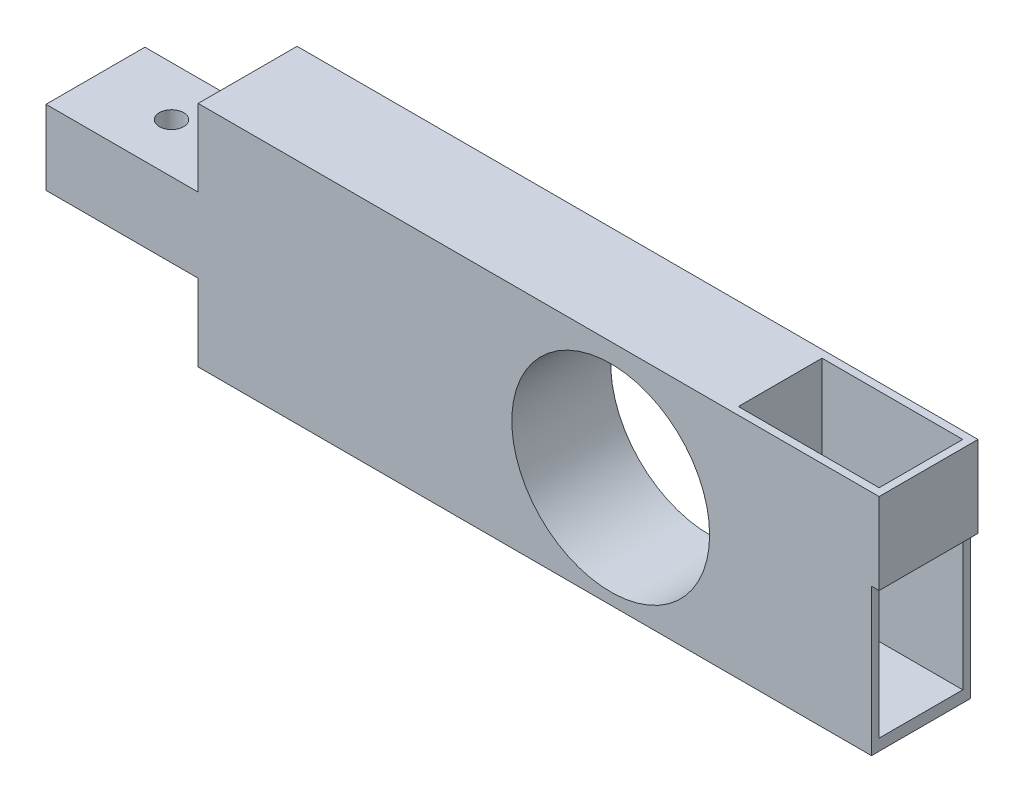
from build123d import *

# Parameters (mm, degrees)
SKETCH1_W               = 355.325
SKETCH1_H               = 30
SKETCH1_R               = 12.5
SKETCH1_R_2             = 1
SKETCH1_W_2             = 50
SKETCH1_H_2             = 5
BOSS_EXTRUDE3_DEPTH     = 13
FILLET3_R               = 5
SKETCH3_R               = 12.5
BOSS_EXTRUDE4_DEPTH     = 13
CUT_EXTRUDE1_REACH      = 359.536
SKETCH4_R               = 1.425
SKETCH5_W               = 63.83
SKETCH5_H               = 18
CUT_EXTRUDE3_DEPTH      = 358.535810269
FILLET4_R               = 5
SKETCH6_W               = 63.8325
SKETCH6_H               = 17
CUT_EXTRUDE4_DEPTH      = 5
SKETCH7_R               = 2.159563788
SKETCH7_R_2             = 1
SKETCH7_R_3             = 2.117135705
SKETCH7_R_4             = 1.916104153
SKETCH7_R_5             = 2.415941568
BOSS_EXTRUDE5_DEPTH     = 8
SKETCH8_R               = 12.5
BOSS_EXTRUDE6_DEPTH     = 13
CUT_EXTRUDE5_DEPTH      = 358.535810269
CUT_EXTRUDE5_DEPTH_BACK = 358.535810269
SKETCH10_R              = 12.5
SKETCH10_R_2            = 13
SKETCH13_W              = 13
SKETCH13_H              = 30
BOSS_EXTRUDE7_DEPTH     = 5
SKETCH14_W              = 13
SKETCH14_H              = 9.8
BOSS_EXTRUDE8_DEPTH     = 5
SKETCH15_R              = 1.6
CUT_EXTRUDE6_DEPTH      = 357.119173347
SKETCH17_W              = 5
SKETCH17_H              = 30
CUT_EXTRUDE7_DEPTH      = 357.826085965
BOSS_EXTRUDE9_DEPTH     = 18.5
SKETCH19_W              = 13
SKETCH19_H              = 10.7
BOSS_EXTRUDE10_DEPTH    = 1
CUT_EXTRUDE8_REACH      = 373.267
SKETCH20_W              = 18.5
SKETCH20_H              = 0.75
SKETCH20_W_2            = 18.502042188


with BuildPart() as part:
    # Sketch1 → Boss-Extrude3 (new body)
    # profile 1 of 3: a face of its own
    with BuildSketch(Plane.XY):
        with Locations((177.6625, 15)):
            Rectangle(SKETCH1_W, SKETCH1_H)
        with Locations(Location((334.55, 14.5, 0), (0, 0, 180))):
            Circle(SKETCH1_R, mode=Mode.SUBTRACT)
        with Locations(Location((20.775, 14.5, 0), (0, 0, 180))):
            Circle(SKETCH1_R, mode=Mode.SUBTRACT)
    # profile 2 of 3: a face of its own
    with BuildSketch(Plane.XY):
        Polygon((177.6625, 0), (50, 0), (50, -5), (50, -17), (177.6625, -17), align=None)
        with Locations(Location((60, -14.5, 0), (0, 0, 180))):
            Circle(SKETCH1_R_2, mode=Mode.SUBTRACT)
        with Locations(Location((68, -14.5, 0), (0, 0, 180))):
            Circle(SKETCH1_R_2, mode=Mode.SUBTRACT)
        with Locations(Location((60, -2.5, 0), (0, 0, 180))):
            Circle(SKETCH1_R_2, mode=Mode.SUBTRACT)
        with Locations(Location((68, -2.5, 0), (0, 0, 180))):
            Circle(SKETCH1_R_2, mode=Mode.SUBTRACT)
    # profile 3 of 3: a face of its own
    with BuildSketch(Plane.XY):
        with Locations((25, -2.5)):
            Rectangle(SKETCH1_W_2, SKETCH1_H_2)
    extrude(amount=BOSS_EXTRUDE3_DEPTH)

    # Fillet3
    fillet3_edges = [part.edges().sort_by_distance(p)[0] for p in [
        (0, -5, 6.5),
        (0, 30, 6.5),
        (355.325, 30, 6.5),
        (355.325, 0, 6.5),
        (177.6625, -17, 6.5),
        (50, -17, 6.5),
    ]]
    fillet(fillet3_edges, radius=FILLET3_R)

    # Sketch3 → Boss-Extrude4 (add)
    with BuildSketch(Plane.XY.offset(13)):
        with Locations(Location((85, 14.5, 0), (0, 0, 180))):
            Circle(SKETCH3_R)
        with Locations(Location((165, 14.5, 0), (0, 0, 180))):
            Circle(SKETCH3_R)
        with Locations(Location((245, 14.5, 0), (0, 0, 180))):
            Circle(SKETCH3_R)
    extrude(amount=BOSS_EXTRUDE4_DEPTH)

    # Sketch4 → Cut-Extrude1 (cut, up to next)
    with BuildSketch(Plane(origin=(0, 0, 0), x_dir=(-1, 0, 0), z_dir=(0, 0, -1)), mode=Mode.PRIVATE) as cut_extrude1_sk1:
        with Locations((-68, -2.5)):
            Circle(SKETCH4_R)
    cut_extrude1_tool1 = extrude(cut_extrude1_sk1.sketch, amount=-CUT_EXTRUDE1_REACH, mode=Mode.PRIVATE) & part.part
    # Sketch4 → Cut-Extrude1 (cut, up to next)
    with BuildSketch(Plane(origin=(0, 0, 0), x_dir=(-1, 0, 0), z_dir=(0, 0, -1)), mode=Mode.PRIVATE) as cut_extrude1_sk2:
        with Locations((-60, -2.5)):
            Circle(SKETCH4_R)
    cut_extrude1_tool2 = extrude(cut_extrude1_sk2.sketch, amount=-CUT_EXTRUDE1_REACH, mode=Mode.PRIVATE) & part.part
    # Sketch4 → Cut-Extrude1 (cut, up to next)
    with BuildSketch(Plane(origin=(0, 0, 0), x_dir=(-1, 0, 0), z_dir=(0, 0, -1)), mode=Mode.PRIVATE) as cut_extrude1_sk3:
        with Locations((-60, -14.5)):
            Circle(SKETCH4_R)
    cut_extrude1_tool3 = extrude(cut_extrude1_sk3.sketch, amount=-CUT_EXTRUDE1_REACH, mode=Mode.PRIVATE) & part.part
    # Sketch4 → Cut-Extrude1 (cut, up to next)
    with BuildSketch(Plane(origin=(0, 0, 0), x_dir=(-1, 0, 0), z_dir=(0, 0, -1)), mode=Mode.PRIVATE) as cut_extrude1_sk4:
        with Locations((-68, -14.5)):
            Circle(SKETCH4_R)
    cut_extrude1_tool4 = extrude(cut_extrude1_sk4.sketch, amount=-CUT_EXTRUDE1_REACH, mode=Mode.PRIVATE) & part.part
    add(cut_extrude1_tool1.solids().sort_by_distance((68, -2.5, 0))[0], mode=Mode.SUBTRACT)
    add(cut_extrude1_tool2.solids().sort_by_distance((60, -2.5, 0))[0], mode=Mode.SUBTRACT)
    add(cut_extrude1_tool3.solids().sort_by_distance((60, -14.5, 0))[0], mode=Mode.SUBTRACT)
    add(cut_extrude1_tool4.solids().sort_by_distance((68, -14.5, 0))[0], mode=Mode.SUBTRACT)

    # Sketch5 → Cut-Extrude3 (cut, through all)
    with BuildSketch(Plane(origin=(0, 0, 0), x_dir=(-1, 0, 0), z_dir=(0, 0, -1))):
        with Locations((-145.7475, -9)):
            Rectangle(SKETCH5_W, SKETCH5_H)
    extrude(amount=-CUT_EXTRUDE3_DEPTH, mode=Mode.SUBTRACT)

    # Fillet4
    fillet4_edges = [part.edges().sort_by_distance(p)[0] for p in [
        (113.8325, -17, 6.5),
    ]]
    fillet(fillet4_edges, radius=FILLET4_R)

    # Sketch6 → Cut-Extrude4 (cut)
    with BuildSketch(Plane.XY.offset(13)):
        with Locations((81.91625, -8.5)):
            Rectangle(SKETCH6_W, SKETCH6_H)
    extrude(amount=-CUT_EXTRUDE4_DEPTH, mode=Mode.SUBTRACT)

    # Sketch7 → Boss-Extrude5 (add)
    # profile 1 of 4: a face of its own
    with BuildSketch(Plane.XY.offset(8)):
        with Locations((60, -14.5)):
            Circle(SKETCH7_R)
        with Locations((60, -14.5)):
            Circle(SKETCH7_R_2, mode=Mode.SUBTRACT)
    # profile 2 of 4: a face of its own
    with BuildSketch(Plane.XY.offset(8)):
        with Locations((60, -2.5)):
            Circle(SKETCH7_R_3)
        with Locations((60, -2.5)):
            Circle(SKETCH7_R_2, mode=Mode.SUBTRACT)
    # profile 3 of 4: a face of its own
    with BuildSketch(Plane.XY.offset(8)):
        with Locations((68, -2.5)):
            Circle(SKETCH7_R_4)
        with Locations((68, -2.5)):
            Circle(SKETCH7_R_2, mode=Mode.SUBTRACT)
    # profile 4 of 4: a face of its own
    with BuildSketch(Plane.XY.offset(8)):
        with Locations((68, -14.5)):
            Circle(SKETCH7_R_5)
        with Locations((68, -14.5)):
            Circle(SKETCH7_R_2, mode=Mode.SUBTRACT)
    extrude(amount=-BOSS_EXTRUDE5_DEPTH)

    # Sketch8 → Boss-Extrude6 (add)
    with BuildSketch(Plane.XY.offset(26)):
        with Locations(Location((85, 14.5, 0), (0, 0, 180))):
            Circle(SKETCH8_R)
        with Locations(Location((165, 14.5, 0), (0, 0, 180))):
            Circle(SKETCH8_R)
        with Locations(Location((245, 14.5, 0), (0, 0, 180))):
            Circle(SKETCH8_R)
    extrude(amount=BOSS_EXTRUDE6_DEPTH)

    # Sketch10 → Cut-Extrude5 (cut, two sides: drawn at the far end of the back side and taken through both)
    # profile 1 of 6: a face of its own
    with BuildSketch(Plane.XY.offset(13).offset(-CUT_EXTRUDE5_DEPTH_BACK)):
        with BuildLine():
            Line((285.325, 19.9), (285.325, 30))
            Line((285.325, 30), (5, 30))
            ThreePointArc((5, 30), (1.464466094, 28.535533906), (0, 25))
            Line((0, 25), (0, 0))
            ThreePointArc((0, 0), (1.464466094, -3.535533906), (5, -5))
            Line((5, -5), (50, -5))
            Line((50, -5), (50, 0))
            Line((50, 0), (113.8325, 0))
            Line((113.8325, 0), (285.325, 0))
            Line((285.325, 0), (285.325, 10.1))
            Line((285.325, 10.1), (265.325, 10.1))
            Line((265.325, 10.1), (265.325, 19.9))
            Line((265.325, 19.9), (285.325, 19.9))
        make_face()
        with Locations((20.775, 14.5)):
            Circle(SKETCH10_R, mode=Mode.SUBTRACT)
        with Locations((85, 14.5)):
            Circle(SKETCH10_R, mode=Mode.SUBTRACT)
        with Locations((165, 14.5)):
            Circle(SKETCH10_R, mode=Mode.SUBTRACT)
        with Locations((245, 14.5)):
            Circle(SKETCH10_R, mode=Mode.SUBTRACT)
    # profile 2 of 6: a face of its own
    with BuildSketch(Plane.XY.offset(13).offset(-CUT_EXTRUDE5_DEPTH_BACK)):
        with Locations((334.55, 14.5)):
            Circle(SKETCH10_R_2)
        with Locations((334.55, 14.5)):
            Circle(SKETCH10_R, mode=Mode.SUBTRACT)
    # profile 3 of 6: a face of its own
    with BuildSketch(Plane.XY.offset(13).offset(-CUT_EXTRUDE5_DEPTH_BACK)):
        with Locations((85, 14.5)):
            Circle(SKETCH10_R)
    # profile 4 of 6: a face of its own
    with BuildSketch(Plane.XY.offset(13).offset(-CUT_EXTRUDE5_DEPTH_BACK)):
        with Locations((165, 14.5)):
            Circle(SKETCH10_R)
    # profile 5 of 6: a face of its own
    with BuildSketch(Plane.XY.offset(13).offset(-CUT_EXTRUDE5_DEPTH_BACK)):
        with Locations((245, 14.5)):
            Circle(SKETCH10_R)
    # profile 6 of 6: a face of its own
    with BuildSketch(Plane.XY.offset(13).offset(-CUT_EXTRUDE5_DEPTH_BACK)):
        with BuildLine():
            Line((50, 0), (50, -5))
            Line((50, -5), (50, -12))
            ThreePointArc((50, -12), (51.464466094, -15.535533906), (55, -17))
            Line((55, -17), (108.8325, -17))
            ThreePointArc((108.8325, -17), (112.368033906, -15.535533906), (113.8325, -12))
            Line((113.8325, -12), (113.8325, 0))
            Line((113.8325, 0), (50, 0))
        make_face()
    extrude(amount=CUT_EXTRUDE5_DEPTH + CUT_EXTRUDE5_DEPTH_BACK, mode=Mode.SUBTRACT)

    # Sketch13 → Boss-Extrude7 (add)
    with BuildSketch(Plane.ZY.offset(-285.325)):
        with Locations((6.5, 15)):
            Rectangle(SKETCH13_W, SKETCH13_H)
    extrude(amount=BOSS_EXTRUDE7_DEPTH)

    # Sketch14 → Boss-Extrude8 (add)
    with BuildSketch(Plane.ZY.offset(-265.325)):
        with Locations((6.5, 15)):
            Rectangle(SKETCH14_W, SKETCH14_H)
    extrude(amount=BOSS_EXTRUDE8_DEPTH)

    # Sketch15 → Cut-Extrude6 (cut, through all)
    with BuildSketch(Plane(origin=(0, 19.9, 0), x_dir=(1, 0, 0), z_dir=(0, 1, 0))):
        with Locations(Location((270.325, -6.5, 0), (0, 0, 180))):
            Circle(SKETCH15_R)
    extrude(amount=-CUT_EXTRUDE6_DEPTH, mode=Mode.SUBTRACT)

    # Sketch17 → Cut-Extrude7 (cut, through all)
    with BuildSketch(Plane.XY.offset(13)):
        with Locations((352.825, 15)):
            Rectangle(SKETCH17_W, SKETCH17_H)
    extrude(amount=-CUT_EXTRUDE7_DEPTH, mode=Mode.SUBTRACT)

    # Sketch18 → Boss-Extrude9 (add)
    with BuildSketch(Plane(origin=(350.325, 0, 0), x_dir=(0, 0, -1), z_dir=(1, 0, 0))):
        Polygon((-11.25, 30), (-11.25, 1.5), (-1.75, 1.5), (-1.75, 30), (0, 30), (0, 0), (-13, 0), (-13, 30), align=None)
    extrude(amount=BOSS_EXTRUDE9_DEPTH)

    # Sketch19 → Boss-Extrude10 (add)
    with BuildSketch(Plane(origin=(368.825, 0, 0), x_dir=(0, 0, -1), z_dir=(1, 0, 0))):
        with Locations((-6.5, 24.65)):
            Rectangle(SKETCH19_W, SKETCH19_H)
    extrude(amount=BOSS_EXTRUDE10_DEPTH)

    # Cut-Extrude8: up to this face of the body (flat: up to its plane)
    cut_extrude8_end = Plane(part.part.faces().sort_by_distance((359.575, 1.5, 6.5))[0])
    # Sketch20 → Cut-Extrude8 (cut, up to the picked face)
    with BuildSketch(Plane(origin=(0, 30, 0), x_dir=(1, 0, 0), z_dir=(0, 1, 0)), mode=Mode.PRIVATE) as cut_extrude8_sk1:
        with Locations((359.575, -1.375)):
            Rectangle(SKETCH20_W, SKETCH20_H)
    cut_extrude8_tool1 = split(extrude(cut_extrude8_sk1.sketch, amount=-CUT_EXTRUDE8_REACH, mode=Mode.PRIVATE), bisect_by=cut_extrude8_end, keep=Keep.BOTH, mode=Mode.PRIVATE)
    # Sketch20 → Cut-Extrude8 (cut, up to the picked face)
    with BuildSketch(Plane(origin=(0, 30, 0), x_dir=(1, 0, 0), z_dir=(0, 1, 0)), mode=Mode.PRIVATE) as cut_extrude8_sk2:
        with Locations((359.576021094, -11.625)):
            Rectangle(SKETCH20_W_2, SKETCH20_H)
    cut_extrude8_tool2 = split(extrude(cut_extrude8_sk2.sketch, amount=-CUT_EXTRUDE8_REACH, mode=Mode.PRIVATE), bisect_by=cut_extrude8_end, keep=Keep.BOTH, mode=Mode.PRIVATE)
    add(cut_extrude8_tool1.solids().sort_by(Axis((359.575, 30, 1.375), (0, -1, 0)))[0], mode=Mode.SUBTRACT)
    add(cut_extrude8_tool2.solids().sort_by(Axis((359.576021, 30, 11.625), (0, -1, 0)))[0], mode=Mode.SUBTRACT)


solid = part.part
